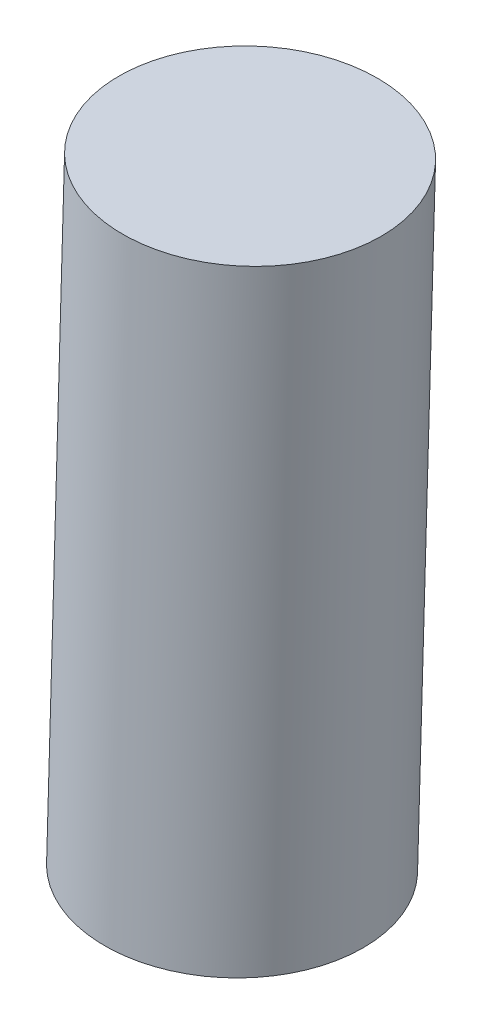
ISO-10303-21;
HEADER;
FILE_DESCRIPTION(('STEP AP214'),'2;1');
FILE_NAME('part.step','',(''),(''),'','','');
FILE_SCHEMA(('AUTOMOTIVE_DESIGN { 1 0 10303 214 1 1 1 1 }'));
ENDSEC;
DATA;
#1=APPLICATION_CONTEXT('core data for automotive mechanical design processes');
#2=APPLICATION_PROTOCOL_DEFINITION('international standard','automotive_design',2000,#1);
#3=PRODUCT_CONTEXT('',#1,'mechanical');
#4=PRODUCT('Part','Part','',(#3));
#5=PRODUCT_RELATED_PRODUCT_CATEGORY('part','',(#4));
#6=PRODUCT_DEFINITION_FORMATION('','',#4);
#7=PRODUCT_DEFINITION_CONTEXT('part definition',#1,'design');
#8=PRODUCT_DEFINITION('design','',#6,#7);
#9=PRODUCT_DEFINITION_SHAPE('','',#8);
#10=(LENGTH_UNIT() NAMED_UNIT(*) SI_UNIT(.MILLI.,.METRE.));
#11=(NAMED_UNIT(*) PLANE_ANGLE_UNIT() SI_UNIT($,.RADIAN.));
#12=(NAMED_UNIT(*) SI_UNIT($,.STERADIAN.) SOLID_ANGLE_UNIT());
#13=UNCERTAINTY_MEASURE_WITH_UNIT(LENGTH_MEASURE(1.E-05),#10,'distance_accuracy_value','');
#14=(GEOMETRIC_REPRESENTATION_CONTEXT(3) GLOBAL_UNCERTAINTY_ASSIGNED_CONTEXT((#13)) GLOBAL_UNIT_ASSIGNED_CONTEXT((#10,
#11,#12)) REPRESENTATION_CONTEXT('',''));
#15=CARTESIAN_POINT('',(0.,0.,0.));
#16=DIRECTION('',(0.,0.,1.));
#17=DIRECTION('',(1.,0.,0.));
#18=AXIS2_PLACEMENT_3D('',#15,#16,#17);
#19=CARTESIAN_POINT('',(-224.214520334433,-4.98537849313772,-92.9921405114));
#20=DIRECTION('',(-0.0287732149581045,-0.999585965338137,0.));
#21=DIRECTION('',(0.999585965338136,-0.0287732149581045,0.));
#22=AXIS2_PLACEMENT_3D('',#19,#20,#21);
#23=CYLINDRICAL_SURFACE('',#22,7.);
#24=CARTESIAN_POINT('',(-224.220313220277,-5.18662424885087,-92.9921405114));
#25=DIRECTION('',(-0.0287732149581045,-0.999585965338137,0.));
#26=DIRECTION('',(0.999585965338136,-0.0287732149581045,0.));
#27=AXIS2_PLACEMENT_3D('',#24,#25,#26);
#28=CIRCLE('',#27,6.99999999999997);
#29=CARTESIAN_POINT('',(-217.22321146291,-5.3880367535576,-92.9921405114));
#30=VERTEX_POINT('',#29);
#31=EDGE_CURVE('E10',#30,#30,#28,.T.);
#32=ORIENTED_EDGE('',*,*,#31,.T.);
#33=EDGE_LOOP('',(#32));
#34=FACE_BOUND('',#33,.T.);
#35=CARTESIAN_POINT('',(-225.180339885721,-38.5381000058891,-92.9921405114));
#36=DIRECTION('',(-0.0287732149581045,-0.999585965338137,0.));
#37=DIRECTION('',(0.999585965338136,-0.0287732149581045,0.));
#38=AXIS2_PLACEMENT_3D('',#35,#36,#37);
#39=CIRCLE('',#38,7.00000000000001);
#40=CARTESIAN_POINT('',(-218.183238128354,-38.7395125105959,-92.9921405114));
#41=VERTEX_POINT('',#40);
#42=EDGE_CURVE('E39',#41,#41,#39,.T.);
#43=ORIENTED_EDGE('',*,*,#42,.F.);
#44=EDGE_LOOP('',(#43));
#45=FACE_BOUND('',#44,.T.);
#46=ADVANCED_FACE('F33',(#34,#45),#23,.T.);
#47=CARTESIAN_POINT('',(-217.223211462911,-5.38803675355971,-92.9921405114));
#48=DIRECTION('',(0.0287732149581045,0.999585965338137,0.));
#49=DIRECTION('',(-0.999585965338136,0.0287732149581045,0.));
#50=AXIS2_PLACEMENT_3D('',#47,#48,#49);
#51=PLANE('',#50);
#52=ORIENTED_EDGE('',*,*,#31,.F.);
#53=EDGE_LOOP('',(#52));
#54=FACE_BOUND('',#53,.T.);
#55=ADVANCED_FACE('F48',(#54),#51,.T.);
#56=CARTESIAN_POINT('',(-225.180339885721,-38.5381000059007,-92.9921405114));
#57=DIRECTION('',(-0.0287732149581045,-0.999585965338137,0.));
#58=DIRECTION('',(0.999585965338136,-0.0287732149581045,0.));
#59=AXIS2_PLACEMENT_3D('',#56,#57,#58);
#60=PLANE('',#59);
#61=ORIENTED_EDGE('',*,*,#42,.T.);
#62=EDGE_LOOP('',(#61));
#63=FACE_BOUND('',#62,.T.);
#64=ADVANCED_FACE('F45',(#63),#60,.T.);
#65=CLOSED_SHELL('',(#46,#55,#64));
#66=MANIFOLD_SOLID_BREP('B2',#65);
#67=ADVANCED_BREP_SHAPE_REPRESENTATION('',(#18,#66),#14);
#68=SHAPE_DEFINITION_REPRESENTATION(#9,#67);
ENDSEC;
END-ISO-10303-21;
